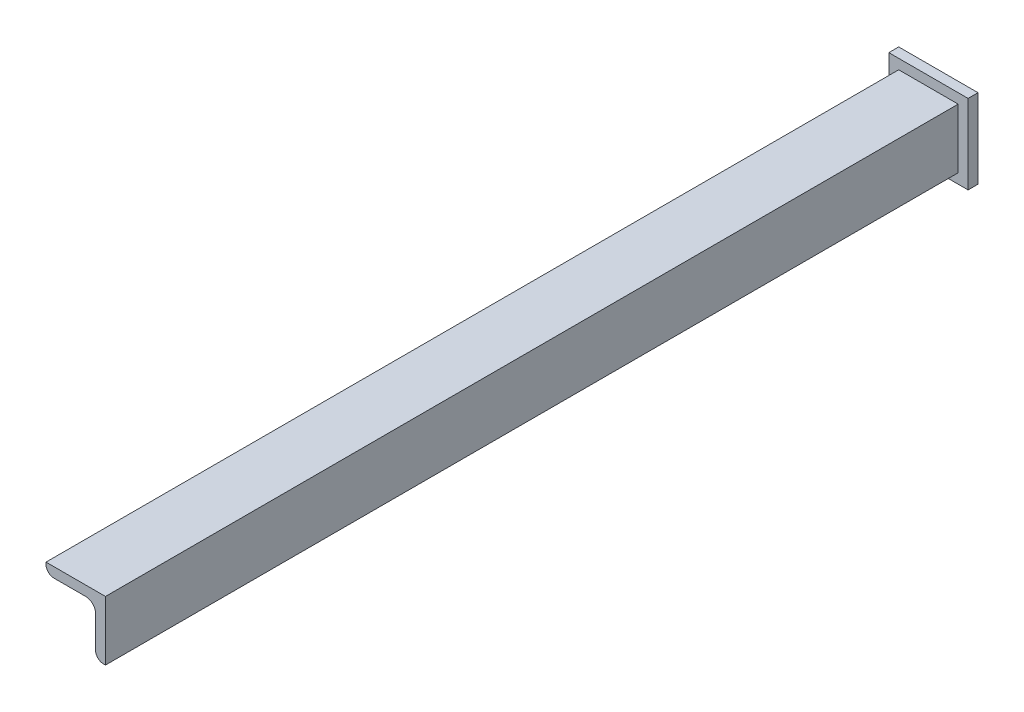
from build123d import *

# Parameters (mm, degrees)
ESQUISSE22_W            = 80.000162
ESQUISSE22_H            = 79.999998
BOSS_EXTRU_1_DEPTH      = 10
BOSS_EXTRU_2_DEPTH      = 860.31
ESQUISSE24_R            = 7.5
ENL_V_MAT_EXTRU_1_DEPTH = 10
CONG_1_R                = 10
CONG_2_R                = 8


with BuildPart() as part:
    # Esquisse22 → Boss.-Extru.1 (new body)
    with BuildSketch(Plane(origin=(0, 0, 0), x_dir=(-1, 0, 0), z_dir=(0, 0, -1))):
        with Locations((-2991.999984, -39.999999)):
            Rectangle(ESQUISSE22_W, ESQUISSE22_H)
    extrude(amount=-BOSS_EXTRU_1_DEPTH)

    # Esquisse23 → Boss.-Extru.2 (add)
    with BuildSketch(Plane.XY.offset(10)):
        Polygon((2961.999893, -10), (3022.001982, -9.999), (3022.000074, -70), (3012.000084, -70), (3012.000084, -20.005001), (2961.999893, -20), align=None)
    extrude(amount=BOSS_EXTRU_2_DEPTH)

    # Esquisse24 → Enl_v. mat.-Extru.1 (cut)
    with BuildSketch(Plane.XY.offset(10)):
        with Locations((2981.893724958, -50.106237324)):
            Circle(ESQUISSE24_R)
    extrude(amount=-ENL_V_MAT_EXTRU_1_DEPTH, mode=Mode.SUBTRACT)

    # Cong_1
    cong_1_edges = [part.edges().sort_by_distance(p)[0] for p in [
        (3012.000084, -20.005001, 440.155),
    ]]
    fillet(cong_1_edges, radius=CONG_1_R)

    # Cong_2
    cong_2_edges = [part.edges().sort_by_distance(p)[0] for p in [
        (2961.999893, -20, 440.155),
        (3012.000084, -70, 440.155),
    ]]
    fillet(cong_2_edges, radius=CONG_2_R)


solid = part.part
